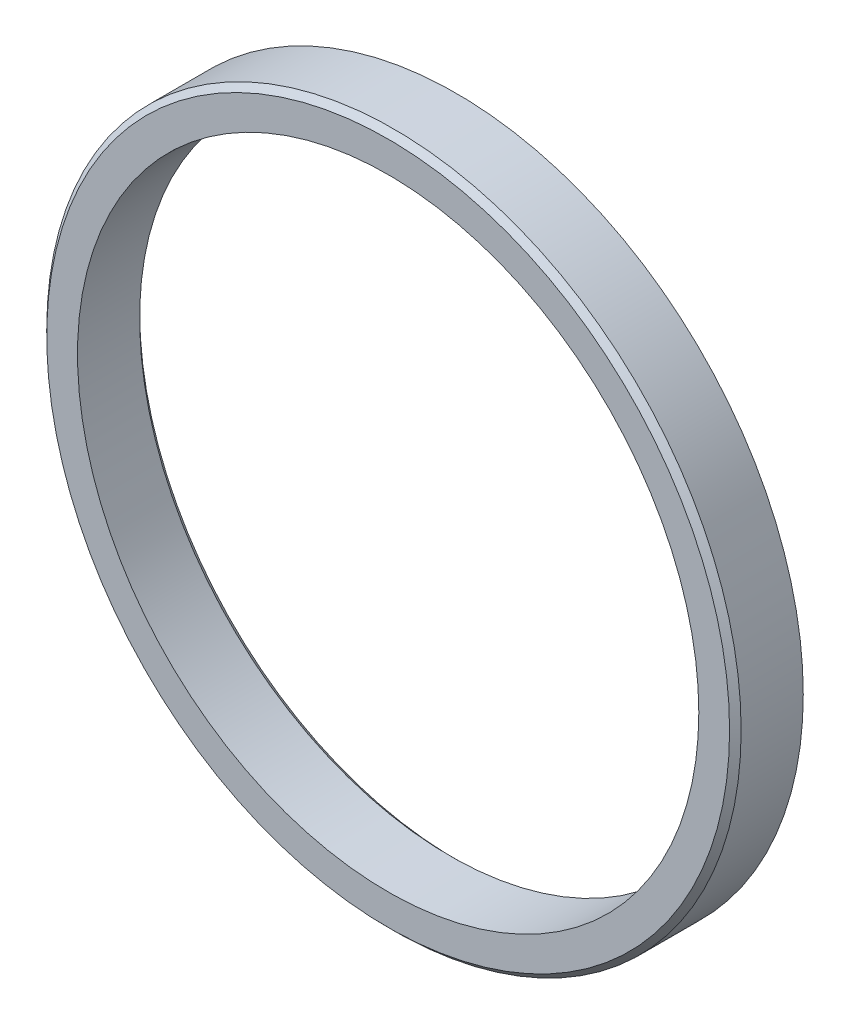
ISO-10303-21;
HEADER;
FILE_DESCRIPTION(('STEP AP214'),'2;1');
FILE_NAME('part.step','',(''),(''),'','','');
FILE_SCHEMA(('AUTOMOTIVE_DESIGN { 1 0 10303 214 1 1 1 1 }'));
ENDSEC;
DATA;
#1=APPLICATION_CONTEXT('core data for automotive mechanical design processes');
#2=APPLICATION_PROTOCOL_DEFINITION('international standard','automotive_design',2000,#1);
#3=PRODUCT_CONTEXT('',#1,'mechanical');
#4=PRODUCT('Part','Part','',(#3));
#5=PRODUCT_RELATED_PRODUCT_CATEGORY('part','',(#4));
#6=PRODUCT_DEFINITION_FORMATION('','',#4);
#7=PRODUCT_DEFINITION_CONTEXT('part definition',#1,'design');
#8=PRODUCT_DEFINITION('design','',#6,#7);
#9=PRODUCT_DEFINITION_SHAPE('','',#8);
#10=(LENGTH_UNIT() NAMED_UNIT(*) SI_UNIT(.MILLI.,.METRE.));
#11=(NAMED_UNIT(*) PLANE_ANGLE_UNIT() SI_UNIT($,.RADIAN.));
#12=(NAMED_UNIT(*) SI_UNIT($,.STERADIAN.) SOLID_ANGLE_UNIT());
#13=UNCERTAINTY_MEASURE_WITH_UNIT(LENGTH_MEASURE(1.E-05),#10,'distance_accuracy_value','');
#14=(GEOMETRIC_REPRESENTATION_CONTEXT(3) GLOBAL_UNCERTAINTY_ASSIGNED_CONTEXT((#13)) GLOBAL_UNIT_ASSIGNED_CONTEXT((#10,
#11,#12)) REPRESENTATION_CONTEXT('',''));
#15=CARTESIAN_POINT('',(0.,0.,0.));
#16=DIRECTION('',(0.,0.,1.));
#17=DIRECTION('',(1.,0.,0.));
#18=AXIS2_PLACEMENT_3D('',#15,#16,#17);
#19=CARTESIAN_POINT('',(0.,118.15,10.75));
#20=DIRECTION('',(0.,0.,-1.));
#21=DIRECTION('',(-1.,0.,0.));
#22=AXIS2_PLACEMENT_3D('',#19,#20,#21);
#23=PLANE('',#22);
#24=CARTESIAN_POINT('',(0.,0.,10.75));
#25=DIRECTION('',(0.,0.,1.));
#26=DIRECTION('',(1.,0.,0.));
#27=AXIS2_PLACEMENT_3D('',#24,#25,#26);
#28=CIRCLE('',#27,107.5);
#29=CARTESIAN_POINT('',(107.5,0.,10.75));
#30=VERTEX_POINT('',#29);
#31=EDGE_CURVE('E10',#30,#30,#28,.T.);
#32=ORIENTED_EDGE('',*,*,#31,.F.);
#33=EDGE_LOOP('',(#32));
#34=FACE_BOUND('',#33,.T.);
#35=CARTESIAN_POINT('',(0.,0.,10.75));
#36=DIRECTION('',(0.,0.,1.));
#37=DIRECTION('',(1.,0.,0.));
#38=AXIS2_PLACEMENT_3D('',#35,#36,#37);
#39=CIRCLE('',#38,118.15);
#40=CARTESIAN_POINT('',(118.15,0.,10.75));
#41=VERTEX_POINT('',#40);
#42=EDGE_CURVE('E55',#41,#41,#39,.T.);
#43=ORIENTED_EDGE('',*,*,#42,.T.);
#44=EDGE_LOOP('',(#43));
#45=FACE_BOUND('',#44,.T.);
#46=ADVANCED_FACE('F33',(#34,#45),#23,.F.);
#47=CARTESIAN_POINT('',(0.,0.,66.6227492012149));
#48=DIRECTION('',(0.,0.,1.));
#49=DIRECTION('',(1.,0.,0.));
#50=AXIS2_PLACEMENT_3D('',#47,#48,#49);
#51=CYLINDRICAL_SURFACE('',#50,107.5);
#52=CARTESIAN_POINT('',(0.,0.,-10.75));
#53=DIRECTION('',(0.,0.,1.));
#54=DIRECTION('',(1.,0.,0.));
#55=AXIS2_PLACEMENT_3D('',#52,#53,#54);
#56=CIRCLE('',#55,107.5);
#57=CARTESIAN_POINT('',(107.5,0.,-10.75));
#58=VERTEX_POINT('',#57);
#59=EDGE_CURVE('E39',#58,#58,#56,.T.);
#60=ORIENTED_EDGE('',*,*,#59,.F.);
#61=EDGE_LOOP('',(#60));
#62=FACE_BOUND('',#61,.T.);
#63=ORIENTED_EDGE('',*,*,#31,.T.);
#64=EDGE_LOOP('',(#63));
#65=FACE_BOUND('',#64,.T.);
#66=ADVANCED_FACE('F80',(#62,#65),#51,.F.);
#67=CARTESIAN_POINT('',(0.,0.,-10.75));
#68=DIRECTION('',(0.,0.,-1.));
#69=DIRECTION('',(-1.,0.,0.));
#70=AXIS2_PLACEMENT_3D('',#67,#68,#69);
#71=CONICAL_SURFACE('',#70,107.5,0.785398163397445);
#72=CARTESIAN_POINT('',(0.,0.,-12.75));
#73=DIRECTION('',(0.,0.,1.));
#74=DIRECTION('',(1.,0.,0.));
#75=AXIS2_PLACEMENT_3D('',#72,#73,#74);
#76=CIRCLE('',#75,109.5);
#77=CARTESIAN_POINT('',(109.5,0.,-12.75));
#78=VERTEX_POINT('',#77);
#79=EDGE_CURVE('E43',#78,#78,#76,.T.);
#80=ORIENTED_EDGE('',*,*,#79,.F.);
#81=EDGE_LOOP('',(#80));
#82=FACE_BOUND('',#81,.T.);
#83=ORIENTED_EDGE('',*,*,#59,.T.);
#84=EDGE_LOOP('',(#83));
#85=FACE_BOUND('',#84,.T.);
#86=ADVANCED_FACE('F75',(#82,#85),#71,.F.);
#87=CARTESIAN_POINT('',(0.,109.5,-12.75));
#88=DIRECTION('',(0.,0.,1.));
#89=DIRECTION('',(1.,0.,0.));
#90=AXIS2_PLACEMENT_3D('',#87,#88,#89);
#91=PLANE('',#90);
#92=CARTESIAN_POINT('',(0.,0.,-12.75));
#93=DIRECTION('',(0.,0.,1.));
#94=DIRECTION('',(1.,0.,0.));
#95=AXIS2_PLACEMENT_3D('',#92,#93,#94);
#96=CIRCLE('',#95,120.15);
#97=CARTESIAN_POINT('',(120.15,0.,-12.75));
#98=VERTEX_POINT('',#97);
#99=EDGE_CURVE('E47',#98,#98,#96,.T.);
#100=ORIENTED_EDGE('',*,*,#99,.F.);
#101=EDGE_LOOP('',(#100));
#102=FACE_BOUND('',#101,.T.);
#103=ORIENTED_EDGE('',*,*,#79,.T.);
#104=EDGE_LOOP('',(#103));
#105=FACE_BOUND('',#104,.T.);
#106=ADVANCED_FACE('F69',(#102,#105),#91,.F.);
#107=CARTESIAN_POINT('',(0.,0.,66.6227492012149));
#108=DIRECTION('',(0.,0.,1.));
#109=DIRECTION('',(1.,0.,0.));
#110=AXIS2_PLACEMENT_3D('',#107,#108,#109);
#111=CYLINDRICAL_SURFACE('',#110,120.15);
#112=CARTESIAN_POINT('',(0.,0.,8.75000000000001));
#113=DIRECTION('',(0.,0.,1.));
#114=DIRECTION('',(1.,0.,0.));
#115=AXIS2_PLACEMENT_3D('',#112,#113,#114);
#116=CIRCLE('',#115,120.15);
#117=CARTESIAN_POINT('',(120.15,0.,8.75000000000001));
#118=VERTEX_POINT('',#117);
#119=EDGE_CURVE('E52',#118,#118,#116,.T.);
#120=ORIENTED_EDGE('',*,*,#119,.F.);
#121=EDGE_LOOP('',(#120));
#122=FACE_BOUND('',#121,.T.);
#123=ORIENTED_EDGE('',*,*,#99,.T.);
#124=EDGE_LOOP('',(#123));
#125=FACE_BOUND('',#124,.T.);
#126=ADVANCED_FACE('F63',(#122,#125),#111,.T.);
#127=CARTESIAN_POINT('',(0.,0.,8.75000000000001));
#128=DIRECTION('',(0.,0.,-1.));
#129=DIRECTION('',(-1.,0.,0.));
#130=AXIS2_PLACEMENT_3D('',#127,#128,#129);
#131=CONICAL_SURFACE('',#130,120.15,0.785398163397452);
#132=ORIENTED_EDGE('',*,*,#42,.F.);
#133=EDGE_LOOP('',(#132));
#134=FACE_BOUND('',#133,.T.);
#135=ORIENTED_EDGE('',*,*,#119,.T.);
#136=EDGE_LOOP('',(#135));
#137=FACE_BOUND('',#136,.T.);
#138=ADVANCED_FACE('F60',(#134,#137),#131,.T.);
#139=CLOSED_SHELL('',(#46,#66,#86,#106,#126,#138));
#140=MANIFOLD_SOLID_BREP('B2',#139);
#141=ADVANCED_BREP_SHAPE_REPRESENTATION('',(#18,#140),#14);
#142=SHAPE_DEFINITION_REPRESENTATION(#9,#141);
ENDSEC;
END-ISO-10303-21;
